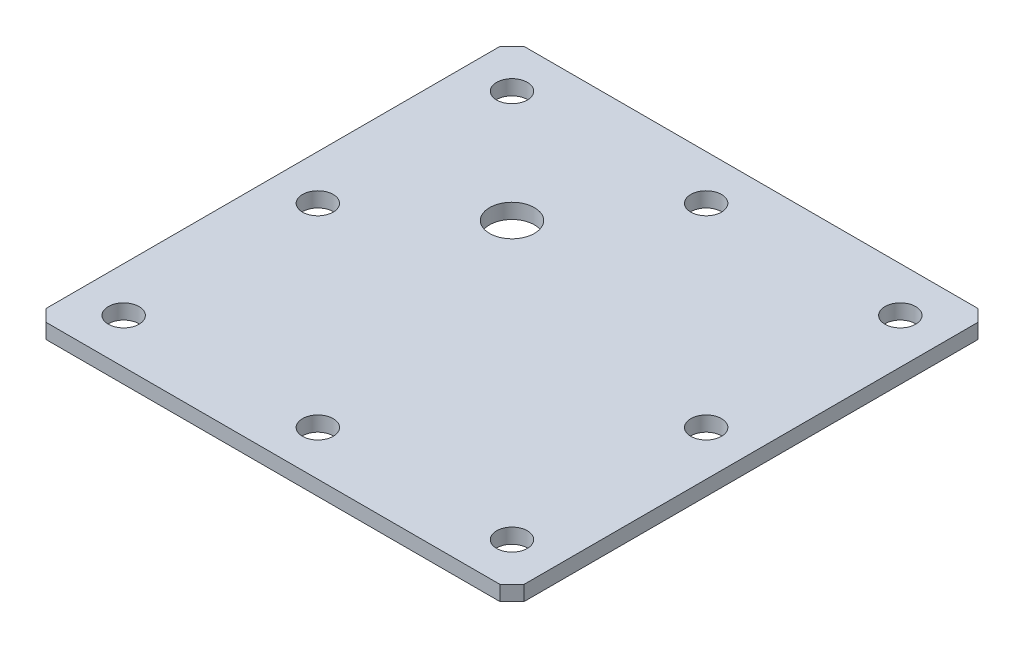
ISO-10303-21;
HEADER;
FILE_DESCRIPTION(('STEP AP214'),'2;1');
FILE_NAME('part.step','',(''),(''),'','','');
FILE_SCHEMA(('AUTOMOTIVE_DESIGN { 1 0 10303 214 1 1 1 1 }'));
ENDSEC;
DATA;
#1=APPLICATION_CONTEXT('core data for automotive mechanical design processes');
#2=APPLICATION_PROTOCOL_DEFINITION('international standard','automotive_design',2000,#1);
#3=PRODUCT_CONTEXT('',#1,'mechanical');
#4=PRODUCT('Part','Part','',(#3));
#5=PRODUCT_RELATED_PRODUCT_CATEGORY('part','',(#4));
#6=PRODUCT_DEFINITION_FORMATION('','',#4);
#7=PRODUCT_DEFINITION_CONTEXT('part definition',#1,'design');
#8=PRODUCT_DEFINITION('design','',#6,#7);
#9=PRODUCT_DEFINITION_SHAPE('','',#8);
#10=(LENGTH_UNIT() NAMED_UNIT(*) SI_UNIT(.MILLI.,.METRE.));
#11=(NAMED_UNIT(*) PLANE_ANGLE_UNIT() SI_UNIT($,.RADIAN.));
#12=(NAMED_UNIT(*) SI_UNIT($,.STERADIAN.) SOLID_ANGLE_UNIT());
#13=UNCERTAINTY_MEASURE_WITH_UNIT(LENGTH_MEASURE(1.E-05),#10,'distance_accuracy_value','');
#14=(GEOMETRIC_REPRESENTATION_CONTEXT(3) GLOBAL_UNCERTAINTY_ASSIGNED_CONTEXT((#13)) GLOBAL_UNIT_ASSIGNED_CONTEXT((#10,
#11,#12)) REPRESENTATION_CONTEXT('',''));
#15=CARTESIAN_POINT('',(0.,0.,0.));
#16=DIRECTION('',(0.,0.,1.));
#17=DIRECTION('',(1.,0.,0.));
#18=AXIS2_PLACEMENT_3D('',#15,#16,#17);
#19=CARTESIAN_POINT('',(-49.4280152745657,3.175,0.));
#20=DIRECTION('',(-1.,0.,0.));
#21=DIRECTION('',(0.,0.,1.));
#22=AXIS2_PLACEMENT_3D('',#19,#20,#21);
#23=PLANE('',#22);
#24=DIRECTION('',(0.,0.,-1.));
#25=VECTOR('',#24,1.);
#26=CARTESIAN_POINT('',(-49.4280152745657,0.,0.));
#27=LINE('',#26,#25);
#28=CARTESIAN_POINT('',(-49.4280152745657,0.,47.8858223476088));
#29=VERTEX_POINT('',#28);
#30=CARTESIAN_POINT('',(-49.4280152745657,0.,-48.6341776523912));
#31=VERTEX_POINT('',#30);
#32=EDGE_CURVE('E160',#29,#31,#27,.T.);
#33=ORIENTED_EDGE('',*,*,#32,.F.);
#34=DIRECTION('',(0.,-1.,0.));
#35=VECTOR('',#34,1.);
#36=CARTESIAN_POINT('',(-49.4280152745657,3.175,47.8858223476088));
#37=LINE('',#36,#35);
#38=CARTESIAN_POINT('',(-49.4280152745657,3.175,47.8858223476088));
#39=VERTEX_POINT('',#38);
#40=EDGE_CURVE('E11',#39,#29,#37,.T.);
#41=ORIENTED_EDGE('',*,*,#40,.F.);
#42=DIRECTION('',(0.,0.,-1.));
#43=VECTOR('',#42,1.);
#44=CARTESIAN_POINT('',(-49.4280152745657,3.175,0.));
#45=LINE('',#44,#43);
#46=CARTESIAN_POINT('',(-49.4280152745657,3.175,-48.6341776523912));
#47=VERTEX_POINT('',#46);
#48=EDGE_CURVE('E454',#39,#47,#45,.T.);
#49=ORIENTED_EDGE('',*,*,#48,.T.);
#50=DIRECTION('',(0.,-1.,0.));
#51=VECTOR('',#50,1.);
#52=CARTESIAN_POINT('',(-49.4280152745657,3.175,-48.6341776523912));
#53=LINE('',#52,#51);
#54=EDGE_CURVE('E56',#47,#31,#53,.T.);
#55=ORIENTED_EDGE('',*,*,#54,.T.);
#56=EDGE_LOOP('',(#33,#41,#49,#55));
#57=FACE_BOUND('',#56,.T.);
#58=ADVANCED_FACE('F39',(#57),#23,.T.);
#59=CARTESIAN_POINT('',(-48.6569188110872,3.175,48.6569188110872));
#60=DIRECTION('',(0.707106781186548,0.,-0.707106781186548));
#61=DIRECTION('',(-0.707106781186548,0.,-0.707106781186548));
#62=AXIS2_PLACEMENT_3D('',#59,#60,#61);
#63=PLANE('',#62);
#64=DIRECTION('',(0.707106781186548,0.,0.707106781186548));
#65=VECTOR('',#64,1.);
#66=CARTESIAN_POINT('',(-48.6569188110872,0.,48.6569188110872));
#67=LINE('',#66,#65);
#68=CARTESIAN_POINT('',(-46.8880152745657,0.,50.4258223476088));
#69=VERTEX_POINT('',#68);
#70=EDGE_CURVE('E162',#29,#69,#67,.T.);
#71=ORIENTED_EDGE('',*,*,#70,.T.);
#72=DIRECTION('',(0.,-1.,0.));
#73=VECTOR('',#72,1.);
#74=CARTESIAN_POINT('',(-46.8880152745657,3.175,50.4258223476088));
#75=LINE('',#74,#73);
#76=CARTESIAN_POINT('',(-46.8880152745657,3.175,50.4258223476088));
#77=VERTEX_POINT('',#76);
#78=EDGE_CURVE('E48',#77,#69,#75,.T.);
#79=ORIENTED_EDGE('',*,*,#78,.F.);
#80=DIRECTION('',(0.707106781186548,0.,0.707106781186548));
#81=VECTOR('',#80,1.);
#82=CARTESIAN_POINT('',(-48.6569188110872,3.175,48.6569188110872));
#83=LINE('',#82,#81);
#84=EDGE_CURVE('E450',#39,#77,#83,.T.);
#85=ORIENTED_EDGE('',*,*,#84,.F.);
#86=ORIENTED_EDGE('',*,*,#40,.T.);
#87=EDGE_LOOP('',(#71,#79,#85,#86));
#88=FACE_BOUND('',#87,.T.);
#89=ADVANCED_FACE('F199',(#88),#63,.F.);
#90=CARTESIAN_POINT('',(0.,3.175,50.4258223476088));
#91=DIRECTION('',(0.,0.,-1.));
#92=DIRECTION('',(-1.,0.,0.));
#93=AXIS2_PLACEMENT_3D('',#90,#91,#92);
#94=PLANE('',#93);
#95=DIRECTION('',(1.,0.,0.));
#96=VECTOR('',#95,1.);
#97=CARTESIAN_POINT('',(0.,0.,50.4258223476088));
#98=LINE('',#97,#96);
#99=CARTESIAN_POINT('',(49.6319847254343,0.,50.4258223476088));
#100=VERTEX_POINT('',#99);
#101=EDGE_CURVE('E165',#69,#100,#98,.T.);
#102=ORIENTED_EDGE('',*,*,#101,.T.);
#103=DIRECTION('',(0.,-1.,0.));
#104=VECTOR('',#103,1.);
#105=CARTESIAN_POINT('',(49.6319847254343,3.175,50.4258223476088));
#106=LINE('',#105,#104);
#107=CARTESIAN_POINT('',(49.6319847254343,3.175,50.4258223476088));
#108=VERTEX_POINT('',#107);
#109=EDGE_CURVE('E187',#108,#100,#106,.T.);
#110=ORIENTED_EDGE('',*,*,#109,.F.);
#111=DIRECTION('',(1.,0.,0.));
#112=VECTOR('',#111,1.);
#113=CARTESIAN_POINT('',(0.,3.175,50.4258223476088));
#114=LINE('',#113,#112);
#115=EDGE_CURVE('E195',#77,#108,#114,.T.);
#116=ORIENTED_EDGE('',*,*,#115,.F.);
#117=ORIENTED_EDGE('',*,*,#78,.T.);
#118=EDGE_LOOP('',(#102,#110,#116,#117));
#119=FACE_BOUND('',#118,.T.);
#120=ADVANCED_FACE('F192',(#119),#94,.F.);
#121=CARTESIAN_POINT('',(50.0289035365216,3.175,50.0289035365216));
#122=DIRECTION('',(-0.707106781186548,0.,-0.707106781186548));
#123=DIRECTION('',(-0.707106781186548,0.,0.707106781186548));
#124=AXIS2_PLACEMENT_3D('',#121,#122,#123);
#125=PLANE('',#124);
#126=DIRECTION('',(0.707106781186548,0.,-0.707106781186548));
#127=VECTOR('',#126,1.);
#128=CARTESIAN_POINT('',(50.0289035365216,0.,50.0289035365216));
#129=LINE('',#128,#127);
#130=CARTESIAN_POINT('',(52.1719847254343,0.,47.8858223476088));
#131=VERTEX_POINT('',#130);
#132=EDGE_CURVE('E168',#100,#131,#129,.T.);
#133=ORIENTED_EDGE('',*,*,#132,.T.);
#134=DIRECTION('',(0.,-1.,0.));
#135=VECTOR('',#134,1.);
#136=CARTESIAN_POINT('',(52.1719847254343,3.175,47.8858223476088));
#137=LINE('',#136,#135);
#138=CARTESIAN_POINT('',(52.1719847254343,3.175,47.8858223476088));
#139=VERTEX_POINT('',#138);
#140=EDGE_CURVE('E184',#139,#131,#137,.T.);
#141=ORIENTED_EDGE('',*,*,#140,.F.);
#142=DIRECTION('',(0.707106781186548,0.,-0.707106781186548));
#143=VECTOR('',#142,1.);
#144=CARTESIAN_POINT('',(50.0289035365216,3.175,50.0289035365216));
#145=LINE('',#144,#143);
#146=EDGE_CURVE('E448',#108,#139,#145,.T.);
#147=ORIENTED_EDGE('',*,*,#146,.F.);
#148=ORIENTED_EDGE('',*,*,#109,.T.);
#149=EDGE_LOOP('',(#133,#141,#147,#148));
#150=FACE_BOUND('',#149,.T.);
#151=ADVANCED_FACE('F290',(#150),#125,.F.);
#152=CARTESIAN_POINT('',(52.1719847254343,3.175,0.));
#153=DIRECTION('',(-1.,0.,0.));
#154=DIRECTION('',(0.,0.,1.));
#155=AXIS2_PLACEMENT_3D('',#152,#153,#154);
#156=PLANE('',#155);
#157=DIRECTION('',(0.,0.,-1.));
#158=VECTOR('',#157,1.);
#159=CARTESIAN_POINT('',(52.1719847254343,0.,0.));
#160=LINE('',#159,#158);
#161=CARTESIAN_POINT('',(52.1719847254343,0.,-48.6341776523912));
#162=VERTEX_POINT('',#161);
#163=EDGE_CURVE('E171',#131,#162,#160,.T.);
#164=ORIENTED_EDGE('',*,*,#163,.T.);
#165=DIRECTION('',(0.,-1.,0.));
#166=VECTOR('',#165,1.);
#167=CARTESIAN_POINT('',(52.1719847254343,3.175,-48.6341776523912));
#168=LINE('',#167,#166);
#169=CARTESIAN_POINT('',(52.1719847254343,3.175,-48.6341776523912));
#170=VERTEX_POINT('',#169);
#171=EDGE_CURVE('E115',#170,#162,#168,.T.);
#172=ORIENTED_EDGE('',*,*,#171,.F.);
#173=DIRECTION('',(0.,0.,-1.));
#174=VECTOR('',#173,1.);
#175=CARTESIAN_POINT('',(52.1719847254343,3.175,0.));
#176=LINE('',#175,#174);
#177=EDGE_CURVE('E124',#139,#170,#176,.T.);
#178=ORIENTED_EDGE('',*,*,#177,.F.);
#179=ORIENTED_EDGE('',*,*,#140,.T.);
#180=EDGE_LOOP('',(#164,#172,#178,#179));
#181=FACE_BOUND('',#180,.T.);
#182=ADVANCED_FACE('F287',(#181),#156,.F.);
#183=CARTESIAN_POINT('',(50.4030811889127,3.175,-50.4030811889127));
#184=DIRECTION('',(0.707106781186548,0.,-0.707106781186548));
#185=DIRECTION('',(-0.707106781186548,0.,-0.707106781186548));
#186=AXIS2_PLACEMENT_3D('',#183,#184,#185);
#187=PLANE('',#186);
#188=DIRECTION('',(0.707106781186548,0.,0.707106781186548));
#189=VECTOR('',#188,1.);
#190=CARTESIAN_POINT('',(50.4030811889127,0.,-50.4030811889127));
#191=LINE('',#190,#189);
#192=CARTESIAN_POINT('',(49.6319847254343,0.,-51.1741776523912));
#193=VERTEX_POINT('',#192);
#194=EDGE_CURVE('E111',#193,#162,#191,.T.);
#195=ORIENTED_EDGE('',*,*,#194,.F.);
#196=DIRECTION('',(0.,-1.,0.));
#197=VECTOR('',#196,1.);
#198=CARTESIAN_POINT('',(49.6319847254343,3.175,-51.1741776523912));
#199=LINE('',#198,#197);
#200=CARTESIAN_POINT('',(49.6319847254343,3.175,-51.1741776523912));
#201=VERTEX_POINT('',#200);
#202=EDGE_CURVE('E106',#201,#193,#199,.T.);
#203=ORIENTED_EDGE('',*,*,#202,.F.);
#204=DIRECTION('',(0.707106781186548,0.,0.707106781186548));
#205=VECTOR('',#204,1.);
#206=CARTESIAN_POINT('',(50.4030811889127,3.175,-50.4030811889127));
#207=LINE('',#206,#205);
#208=EDGE_CURVE('E109',#201,#170,#207,.T.);
#209=ORIENTED_EDGE('',*,*,#208,.T.);
#210=ORIENTED_EDGE('',*,*,#171,.T.);
#211=EDGE_LOOP('',(#195,#203,#209,#210));
#212=FACE_BOUND('',#211,.T.);
#213=ADVANCED_FACE('F108',(#212),#187,.T.);
#214=CARTESIAN_POINT('',(0.,3.175,-51.1741776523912));
#215=DIRECTION('',(0.,0.,-1.));
#216=DIRECTION('',(-1.,0.,0.));
#217=AXIS2_PLACEMENT_3D('',#214,#215,#216);
#218=PLANE('',#217);
#219=DIRECTION('',(1.,0.,0.));
#220=VECTOR('',#219,1.);
#221=CARTESIAN_POINT('',(0.,0.,-51.1741776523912));
#222=LINE('',#221,#220);
#223=CARTESIAN_POINT('',(-46.8880152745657,0.,-51.1741776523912));
#224=VERTEX_POINT('',#223);
#225=EDGE_CURVE('E175',#224,#193,#222,.T.);
#226=ORIENTED_EDGE('',*,*,#225,.F.);
#227=DIRECTION('',(0.,-1.,0.));
#228=VECTOR('',#227,1.);
#229=CARTESIAN_POINT('',(-46.8880152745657,3.175,-51.1741776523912));
#230=LINE('',#229,#228);
#231=CARTESIAN_POINT('',(-46.8880152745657,3.175,-51.1741776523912));
#232=VERTEX_POINT('',#231);
#233=EDGE_CURVE('E81',#232,#224,#230,.T.);
#234=ORIENTED_EDGE('',*,*,#233,.F.);
#235=DIRECTION('',(1.,0.,0.));
#236=VECTOR('',#235,1.);
#237=CARTESIAN_POINT('',(0.,3.175,-51.1741776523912));
#238=LINE('',#237,#236);
#239=EDGE_CURVE('E122',#232,#201,#238,.T.);
#240=ORIENTED_EDGE('',*,*,#239,.T.);
#241=ORIENTED_EDGE('',*,*,#202,.T.);
#242=EDGE_LOOP('',(#226,#234,#240,#241));
#243=FACE_BOUND('',#242,.T.);
#244=ADVANCED_FACE('F127',(#243),#218,.T.);
#245=CARTESIAN_POINT('',(-39.9030152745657,3.175,-41.6491776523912));
#246=DIRECTION('',(0.,-1.,0.));
#247=DIRECTION('',(0.,0.,-1.));
#248=AXIS2_PLACEMENT_3D('',#245,#246,#247);
#249=CYLINDRICAL_SURFACE('',#248,3.2639);
#250=CARTESIAN_POINT('',(-39.9030152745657,3.175,-41.6491776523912));
#251=DIRECTION('',(0.,1.,0.));
#252=DIRECTION('',(0.,0.,1.));
#253=AXIS2_PLACEMENT_3D('',#250,#251,#252);
#254=CIRCLE('',#253,3.2639);
#255=CARTESIAN_POINT('',(-39.9030152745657,3.175,-38.3852776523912));
#256=VERTEX_POINT('',#255);
#257=EDGE_CURVE('E456',#256,#256,#254,.T.);
#258=ORIENTED_EDGE('',*,*,#257,.T.);
#259=EDGE_LOOP('',(#258));
#260=FACE_BOUND('',#259,.T.);
#261=CARTESIAN_POINT('',(-39.9030152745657,0.,-41.6491776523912));
#262=DIRECTION('',(0.,1.,0.));
#263=DIRECTION('',(0.,0.,1.));
#264=AXIS2_PLACEMENT_3D('',#261,#262,#263);
#265=CIRCLE('',#264,3.2639);
#266=CARTESIAN_POINT('',(-39.9030152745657,0.,-38.3852776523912));
#267=VERTEX_POINT('',#266);
#268=EDGE_CURVE('E157',#267,#267,#265,.T.);
#269=ORIENTED_EDGE('',*,*,#268,.F.);
#270=EDGE_LOOP('',(#269));
#271=FACE_BOUND('',#270,.T.);
#272=ADVANCED_FACE('F210',(#260,#271),#249,.F.);
#273=CARTESIAN_POINT('',(42.6469847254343,3.175,-41.6491776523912));
#274=DIRECTION('',(0.,-1.,0.));
#275=DIRECTION('',(0.,0.,-1.));
#276=AXIS2_PLACEMENT_3D('',#273,#274,#275);
#277=CYLINDRICAL_SURFACE('',#276,3.2639);
#278=CARTESIAN_POINT('',(42.6469847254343,3.175,-41.6491776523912));
#279=DIRECTION('',(0.,1.,0.));
#280=DIRECTION('',(0.,0.,1.));
#281=AXIS2_PLACEMENT_3D('',#278,#279,#280);
#282=CIRCLE('',#281,3.2639);
#283=CARTESIAN_POINT('',(42.6469847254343,3.175,-38.3852776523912));
#284=VERTEX_POINT('',#283);
#285=EDGE_CURVE('E459',#284,#284,#282,.T.);
#286=ORIENTED_EDGE('',*,*,#285,.T.);
#287=EDGE_LOOP('',(#286));
#288=FACE_BOUND('',#287,.T.);
#289=CARTESIAN_POINT('',(42.6469847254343,0.,-41.6491776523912));
#290=DIRECTION('',(0.,1.,0.));
#291=DIRECTION('',(0.,0.,1.));
#292=AXIS2_PLACEMENT_3D('',#289,#290,#291);
#293=CIRCLE('',#292,3.2639);
#294=CARTESIAN_POINT('',(42.6469847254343,0.,-38.3852776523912));
#295=VERTEX_POINT('',#294);
#296=EDGE_CURVE('E154',#295,#295,#293,.T.);
#297=ORIENTED_EDGE('',*,*,#296,.F.);
#298=EDGE_LOOP('',(#297));
#299=FACE_BOUND('',#298,.T.);
#300=ADVANCED_FACE('F213',(#288,#299),#277,.F.);
#301=CARTESIAN_POINT('',(42.6469847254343,3.175,-0.374177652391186));
#302=DIRECTION('',(0.,-1.,0.));
#303=DIRECTION('',(0.,0.,-1.));
#304=AXIS2_PLACEMENT_3D('',#301,#302,#303);
#305=CYLINDRICAL_SURFACE('',#304,3.2639);
#306=CARTESIAN_POINT('',(42.6469847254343,3.175,-0.374177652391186));
#307=DIRECTION('',(0.,1.,0.));
#308=DIRECTION('',(0.,0.,1.));
#309=AXIS2_PLACEMENT_3D('',#306,#307,#308);
#310=CIRCLE('',#309,3.2639);
#311=CARTESIAN_POINT('',(42.6469847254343,3.175,2.88972234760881));
#312=VERTEX_POINT('',#311);
#313=EDGE_CURVE('E462',#312,#312,#310,.T.);
#314=ORIENTED_EDGE('',*,*,#313,.T.);
#315=EDGE_LOOP('',(#314));
#316=FACE_BOUND('',#315,.T.);
#317=CARTESIAN_POINT('',(42.6469847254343,0.,-0.374177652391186));
#318=DIRECTION('',(0.,1.,0.));
#319=DIRECTION('',(0.,0.,1.));
#320=AXIS2_PLACEMENT_3D('',#317,#318,#319);
#321=CIRCLE('',#320,3.2639);
#322=CARTESIAN_POINT('',(42.6469847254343,0.,2.88972234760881));
#323=VERTEX_POINT('',#322);
#324=EDGE_CURVE('E151',#323,#323,#321,.T.);
#325=ORIENTED_EDGE('',*,*,#324,.F.);
#326=EDGE_LOOP('',(#325));
#327=FACE_BOUND('',#326,.T.);
#328=ADVANCED_FACE('F217',(#316,#327),#305,.F.);
#329=CARTESIAN_POINT('',(42.6469847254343,3.175,40.9008223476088));
#330=DIRECTION('',(0.,-1.,0.));
#331=DIRECTION('',(0.,0.,-1.));
#332=AXIS2_PLACEMENT_3D('',#329,#330,#331);
#333=CYLINDRICAL_SURFACE('',#332,3.2639);
#334=CARTESIAN_POINT('',(42.6469847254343,3.175,40.9008223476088));
#335=DIRECTION('',(0.,1.,0.));
#336=DIRECTION('',(0.,0.,1.));
#337=AXIS2_PLACEMENT_3D('',#334,#335,#336);
#338=CIRCLE('',#337,3.2639);
#339=CARTESIAN_POINT('',(42.6469847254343,3.175,44.1647223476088));
#340=VERTEX_POINT('',#339);
#341=EDGE_CURVE('E465',#340,#340,#338,.T.);
#342=ORIENTED_EDGE('',*,*,#341,.T.);
#343=EDGE_LOOP('',(#342));
#344=FACE_BOUND('',#343,.T.);
#345=CARTESIAN_POINT('',(42.6469847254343,0.,40.9008223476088));
#346=DIRECTION('',(0.,1.,0.));
#347=DIRECTION('',(0.,0.,1.));
#348=AXIS2_PLACEMENT_3D('',#345,#346,#347);
#349=CIRCLE('',#348,3.2639);
#350=CARTESIAN_POINT('',(42.6469847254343,0.,44.1647223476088));
#351=VERTEX_POINT('',#350);
#352=EDGE_CURVE('E148',#351,#351,#349,.T.);
#353=ORIENTED_EDGE('',*,*,#352,.F.);
#354=EDGE_LOOP('',(#353));
#355=FACE_BOUND('',#354,.T.);
#356=ADVANCED_FACE('F221',(#344,#355),#333,.F.);
#357=CARTESIAN_POINT('',(-39.9030152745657,3.175,40.9008223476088));
#358=DIRECTION('',(0.,-1.,0.));
#359=DIRECTION('',(0.,0.,-1.));
#360=AXIS2_PLACEMENT_3D('',#357,#358,#359);
#361=CYLINDRICAL_SURFACE('',#360,3.2639);
#362=CARTESIAN_POINT('',(-39.9030152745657,3.175,40.9008223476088));
#363=DIRECTION('',(0.,1.,0.));
#364=DIRECTION('',(0.,0.,1.));
#365=AXIS2_PLACEMENT_3D('',#362,#363,#364);
#366=CIRCLE('',#365,3.2639);
#367=CARTESIAN_POINT('',(-39.9030152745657,3.175,44.1647223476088));
#368=VERTEX_POINT('',#367);
#369=EDGE_CURVE('E468',#368,#368,#366,.T.);
#370=ORIENTED_EDGE('',*,*,#369,.T.);
#371=EDGE_LOOP('',(#370));
#372=FACE_BOUND('',#371,.T.);
#373=CARTESIAN_POINT('',(-39.9030152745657,0.,40.9008223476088));
#374=DIRECTION('',(0.,1.,0.));
#375=DIRECTION('',(0.,0.,1.));
#376=AXIS2_PLACEMENT_3D('',#373,#374,#375);
#377=CIRCLE('',#376,3.2639);
#378=CARTESIAN_POINT('',(-39.9030152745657,0.,44.1647223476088));
#379=VERTEX_POINT('',#378);
#380=EDGE_CURVE('E145',#379,#379,#377,.T.);
#381=ORIENTED_EDGE('',*,*,#380,.F.);
#382=EDGE_LOOP('',(#381));
#383=FACE_BOUND('',#382,.T.);
#384=ADVANCED_FACE('F225',(#372,#383),#361,.F.);
#385=CARTESIAN_POINT('',(-39.9030152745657,3.175,-0.374177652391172));
#386=DIRECTION('',(0.,-1.,0.));
#387=DIRECTION('',(0.,0.,-1.));
#388=AXIS2_PLACEMENT_3D('',#385,#386,#387);
#389=CYLINDRICAL_SURFACE('',#388,3.2639);
#390=CARTESIAN_POINT('',(-39.9030152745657,3.175,-0.374177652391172));
#391=DIRECTION('',(0.,1.,0.));
#392=DIRECTION('',(0.,0.,1.));
#393=AXIS2_PLACEMENT_3D('',#390,#391,#392);
#394=CIRCLE('',#393,3.2639);
#395=CARTESIAN_POINT('',(-39.9030152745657,3.175,2.88972234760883));
#396=VERTEX_POINT('',#395);
#397=EDGE_CURVE('E471',#396,#396,#394,.T.);
#398=ORIENTED_EDGE('',*,*,#397,.T.);
#399=EDGE_LOOP('',(#398));
#400=FACE_BOUND('',#399,.T.);
#401=CARTESIAN_POINT('',(-39.9030152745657,0.,-0.374177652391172));
#402=DIRECTION('',(0.,1.,0.));
#403=DIRECTION('',(0.,0.,1.));
#404=AXIS2_PLACEMENT_3D('',#401,#402,#403);
#405=CIRCLE('',#404,3.2639);
#406=CARTESIAN_POINT('',(-39.9030152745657,0.,2.88972234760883));
#407=VERTEX_POINT('',#406);
#408=EDGE_CURVE('E142',#407,#407,#405,.T.);
#409=ORIENTED_EDGE('',*,*,#408,.F.);
#410=EDGE_LOOP('',(#409));
#411=FACE_BOUND('',#410,.T.);
#412=ADVANCED_FACE('F229',(#400,#411),#389,.F.);
#413=CARTESIAN_POINT('',(1.37198472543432,3.175,-41.6491776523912));
#414=DIRECTION('',(0.,-1.,0.));
#415=DIRECTION('',(0.,0.,-1.));
#416=AXIS2_PLACEMENT_3D('',#413,#414,#415);
#417=CYLINDRICAL_SURFACE('',#416,3.2639);
#418=CARTESIAN_POINT('',(1.37198472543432,3.175,-41.6491776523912));
#419=DIRECTION('',(0.,1.,0.));
#420=DIRECTION('',(0.,0.,1.));
#421=AXIS2_PLACEMENT_3D('',#418,#419,#420);
#422=CIRCLE('',#421,3.2639);
#423=CARTESIAN_POINT('',(1.37198472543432,3.175,-38.3852776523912));
#424=VERTEX_POINT('',#423);
#425=EDGE_CURVE('E474',#424,#424,#422,.T.);
#426=ORIENTED_EDGE('',*,*,#425,.T.);
#427=EDGE_LOOP('',(#426));
#428=FACE_BOUND('',#427,.T.);
#429=CARTESIAN_POINT('',(1.37198472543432,0.,-41.6491776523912));
#430=DIRECTION('',(0.,1.,0.));
#431=DIRECTION('',(0.,0.,1.));
#432=AXIS2_PLACEMENT_3D('',#429,#430,#431);
#433=CIRCLE('',#432,3.2639);
#434=CARTESIAN_POINT('',(1.37198472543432,0.,-38.3852776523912));
#435=VERTEX_POINT('',#434);
#436=EDGE_CURVE('E139',#435,#435,#433,.T.);
#437=ORIENTED_EDGE('',*,*,#436,.F.);
#438=EDGE_LOOP('',(#437));
#439=FACE_BOUND('',#438,.T.);
#440=ADVANCED_FACE('F233',(#428,#439),#417,.F.);
#441=CARTESIAN_POINT('',(1.37198472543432,3.175,40.9008223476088));
#442=DIRECTION('',(0.,-1.,0.));
#443=DIRECTION('',(0.,0.,-1.));
#444=AXIS2_PLACEMENT_3D('',#441,#442,#443);
#445=CYLINDRICAL_SURFACE('',#444,3.2639);
#446=CARTESIAN_POINT('',(1.37198472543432,3.175,40.9008223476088));
#447=DIRECTION('',(0.,1.,0.));
#448=DIRECTION('',(0.,0.,1.));
#449=AXIS2_PLACEMENT_3D('',#446,#447,#448);
#450=CIRCLE('',#449,3.2639);
#451=CARTESIAN_POINT('',(1.37198472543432,3.175,44.1647223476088));
#452=VERTEX_POINT('',#451);
#453=EDGE_CURVE('E248',#452,#452,#450,.T.);
#454=ORIENTED_EDGE('',*,*,#453,.T.);
#455=EDGE_LOOP('',(#454));
#456=FACE_BOUND('',#455,.T.);
#457=CARTESIAN_POINT('',(1.37198472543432,0.,40.9008223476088));
#458=DIRECTION('',(0.,1.,0.));
#459=DIRECTION('',(0.,0.,1.));
#460=AXIS2_PLACEMENT_3D('',#457,#458,#459);
#461=CIRCLE('',#460,3.2639);
#462=CARTESIAN_POINT('',(1.37198472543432,0.,44.1647223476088));
#463=VERTEX_POINT('',#462);
#464=EDGE_CURVE('E136',#463,#463,#461,.T.);
#465=ORIENTED_EDGE('',*,*,#464,.F.);
#466=EDGE_LOOP('',(#465));
#467=FACE_BOUND('',#466,.T.);
#468=ADVANCED_FACE('F236',(#456,#467),#445,.F.);
#469=CARTESIAN_POINT('',(-16.0905152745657,3.175,-17.8366776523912));
#470=DIRECTION('',(0.,-1.,0.));
#471=DIRECTION('',(0.,0.,-1.));
#472=AXIS2_PLACEMENT_3D('',#469,#470,#471);
#473=CYLINDRICAL_SURFACE('',#472,4.7625);
#474=CARTESIAN_POINT('',(-16.0905152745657,3.175,-17.8366776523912));
#475=DIRECTION('',(0.,1.,0.));
#476=DIRECTION('',(0.,0.,1.));
#477=AXIS2_PLACEMENT_3D('',#474,#475,#476);
#478=CIRCLE('',#477,4.7625);
#479=CARTESIAN_POINT('',(-16.0905152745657,3.175,-13.0741776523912));
#480=VERTEX_POINT('',#479);
#481=EDGE_CURVE('E180',#480,#480,#478,.T.);
#482=ORIENTED_EDGE('',*,*,#481,.T.);
#483=EDGE_LOOP('',(#482));
#484=FACE_BOUND('',#483,.T.);
#485=CARTESIAN_POINT('',(-16.0905152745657,0.,-17.8366776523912));
#486=DIRECTION('',(0.,1.,0.));
#487=DIRECTION('',(0.,0.,1.));
#488=AXIS2_PLACEMENT_3D('',#485,#486,#487);
#489=CIRCLE('',#488,4.7625);
#490=CARTESIAN_POINT('',(-16.0905152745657,0.,-13.0741776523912));
#491=VERTEX_POINT('',#490);
#492=EDGE_CURVE('E133',#491,#491,#489,.T.);
#493=ORIENTED_EDGE('',*,*,#492,.F.);
#494=EDGE_LOOP('',(#493));
#495=FACE_BOUND('',#494,.T.);
#496=ADVANCED_FACE('F41',(#484,#495),#473,.F.);
#497=CARTESIAN_POINT('',(-49.0310964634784,3.175,-49.0310964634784));
#498=DIRECTION('',(-0.707106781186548,0.,-0.707106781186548));
#499=DIRECTION('',(-0.707106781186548,0.,0.707106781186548));
#500=AXIS2_PLACEMENT_3D('',#497,#498,#499);
#501=PLANE('',#500);
#502=DIRECTION('',(0.707106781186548,0.,-0.707106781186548));
#503=VECTOR('',#502,1.);
#504=CARTESIAN_POINT('',(-49.0310964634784,0.,-49.0310964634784));
#505=LINE('',#504,#503);
#506=EDGE_CURVE('E177',#31,#224,#505,.T.);
#507=ORIENTED_EDGE('',*,*,#506,.F.);
#508=ORIENTED_EDGE('',*,*,#54,.F.);
#509=DIRECTION('',(0.707106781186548,0.,-0.707106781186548));
#510=VECTOR('',#509,1.);
#511=CARTESIAN_POINT('',(-49.0310964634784,3.175,-49.0310964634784));
#512=LINE('',#511,#510);
#513=EDGE_CURVE('E128',#47,#232,#512,.T.);
#514=ORIENTED_EDGE('',*,*,#513,.T.);
#515=ORIENTED_EDGE('',*,*,#233,.T.);
#516=EDGE_LOOP('',(#507,#508,#514,#515));
#517=FACE_BOUND('',#516,.T.);
#518=ADVANCED_FACE('F243',(#517),#501,.T.);
#519=CARTESIAN_POINT('',(0.,3.175,0.));
#520=DIRECTION('',(0.,1.,0.));
#521=DIRECTION('',(0.,0.,1.));
#522=AXIS2_PLACEMENT_3D('',#519,#520,#521);
#523=PLANE('',#522);
#524=ORIENTED_EDGE('',*,*,#481,.F.);
#525=EDGE_LOOP('',(#524));
#526=FACE_BOUND('',#525,.T.);
#527=ORIENTED_EDGE('',*,*,#453,.F.);
#528=EDGE_LOOP('',(#527));
#529=FACE_BOUND('',#528,.T.);
#530=ORIENTED_EDGE('',*,*,#425,.F.);
#531=EDGE_LOOP('',(#530));
#532=FACE_BOUND('',#531,.T.);
#533=ORIENTED_EDGE('',*,*,#397,.F.);
#534=EDGE_LOOP('',(#533));
#535=FACE_BOUND('',#534,.T.);
#536=ORIENTED_EDGE('',*,*,#369,.F.);
#537=EDGE_LOOP('',(#536));
#538=FACE_BOUND('',#537,.T.);
#539=ORIENTED_EDGE('',*,*,#341,.F.);
#540=EDGE_LOOP('',(#539));
#541=FACE_BOUND('',#540,.T.);
#542=ORIENTED_EDGE('',*,*,#313,.F.);
#543=EDGE_LOOP('',(#542));
#544=FACE_BOUND('',#543,.T.);
#545=ORIENTED_EDGE('',*,*,#285,.F.);
#546=EDGE_LOOP('',(#545));
#547=FACE_BOUND('',#546,.T.);
#548=ORIENTED_EDGE('',*,*,#257,.F.);
#549=EDGE_LOOP('',(#548));
#550=FACE_BOUND('',#549,.T.);
#551=ORIENTED_EDGE('',*,*,#48,.F.);
#552=ORIENTED_EDGE('',*,*,#84,.T.);
#553=ORIENTED_EDGE('',*,*,#115,.T.);
#554=ORIENTED_EDGE('',*,*,#146,.T.);
#555=ORIENTED_EDGE('',*,*,#177,.T.);
#556=ORIENTED_EDGE('',*,*,#208,.F.);
#557=ORIENTED_EDGE('',*,*,#239,.F.);
#558=ORIENTED_EDGE('',*,*,#513,.F.);
#559=EDGE_LOOP('',(#551,#552,#553,#554,#555,#556,#557,#558));
#560=FACE_BOUND('',#559,.T.);
#561=ADVANCED_FACE('F120',(#526,#529,#532,#535,#538,#541,#544,#547,#550,#560),#523,.T.);
#562=CARTESIAN_POINT('',(0.,0.,0.));
#563=DIRECTION('',(0.,1.,0.));
#564=DIRECTION('',(0.,0.,1.));
#565=AXIS2_PLACEMENT_3D('',#562,#563,#564);
#566=PLANE('',#565);
#567=ORIENTED_EDGE('',*,*,#492,.T.);
#568=EDGE_LOOP('',(#567));
#569=FACE_BOUND('',#568,.T.);
#570=ORIENTED_EDGE('',*,*,#464,.T.);
#571=EDGE_LOOP('',(#570));
#572=FACE_BOUND('',#571,.T.);
#573=ORIENTED_EDGE('',*,*,#436,.T.);
#574=EDGE_LOOP('',(#573));
#575=FACE_BOUND('',#574,.T.);
#576=ORIENTED_EDGE('',*,*,#408,.T.);
#577=EDGE_LOOP('',(#576));
#578=FACE_BOUND('',#577,.T.);
#579=ORIENTED_EDGE('',*,*,#380,.T.);
#580=EDGE_LOOP('',(#579));
#581=FACE_BOUND('',#580,.T.);
#582=ORIENTED_EDGE('',*,*,#352,.T.);
#583=EDGE_LOOP('',(#582));
#584=FACE_BOUND('',#583,.T.);
#585=ORIENTED_EDGE('',*,*,#324,.T.);
#586=EDGE_LOOP('',(#585));
#587=FACE_BOUND('',#586,.T.);
#588=ORIENTED_EDGE('',*,*,#296,.T.);
#589=EDGE_LOOP('',(#588));
#590=FACE_BOUND('',#589,.T.);
#591=ORIENTED_EDGE('',*,*,#268,.T.);
#592=EDGE_LOOP('',(#591));
#593=FACE_BOUND('',#592,.T.);
#594=ORIENTED_EDGE('',*,*,#32,.T.);
#595=ORIENTED_EDGE('',*,*,#506,.T.);
#596=ORIENTED_EDGE('',*,*,#225,.T.);
#597=ORIENTED_EDGE('',*,*,#194,.T.);
#598=ORIENTED_EDGE('',*,*,#163,.F.);
#599=ORIENTED_EDGE('',*,*,#132,.F.);
#600=ORIENTED_EDGE('',*,*,#101,.F.);
#601=ORIENTED_EDGE('',*,*,#70,.F.);
#602=EDGE_LOOP('',(#594,#595,#596,#597,#598,#599,#600,#601));
#603=FACE_BOUND('',#602,.T.);
#604=ADVANCED_FACE('F201',(#569,#572,#575,#578,#581,#584,#587,#590,#593,#603),#566,.F.);
#605=CLOSED_SHELL('',(#58,#89,#120,#151,#182,#213,#244,#272,#300,#328,#356,#384,#412,#440,#468,
#496,#518,#561,#604));
#606=MANIFOLD_SOLID_BREP('B2',#605);
#607=ADVANCED_BREP_SHAPE_REPRESENTATION('',(#18,#606),#14);
#608=SHAPE_DEFINITION_REPRESENTATION(#9,#607);
ENDSEC;
END-ISO-10303-21;
